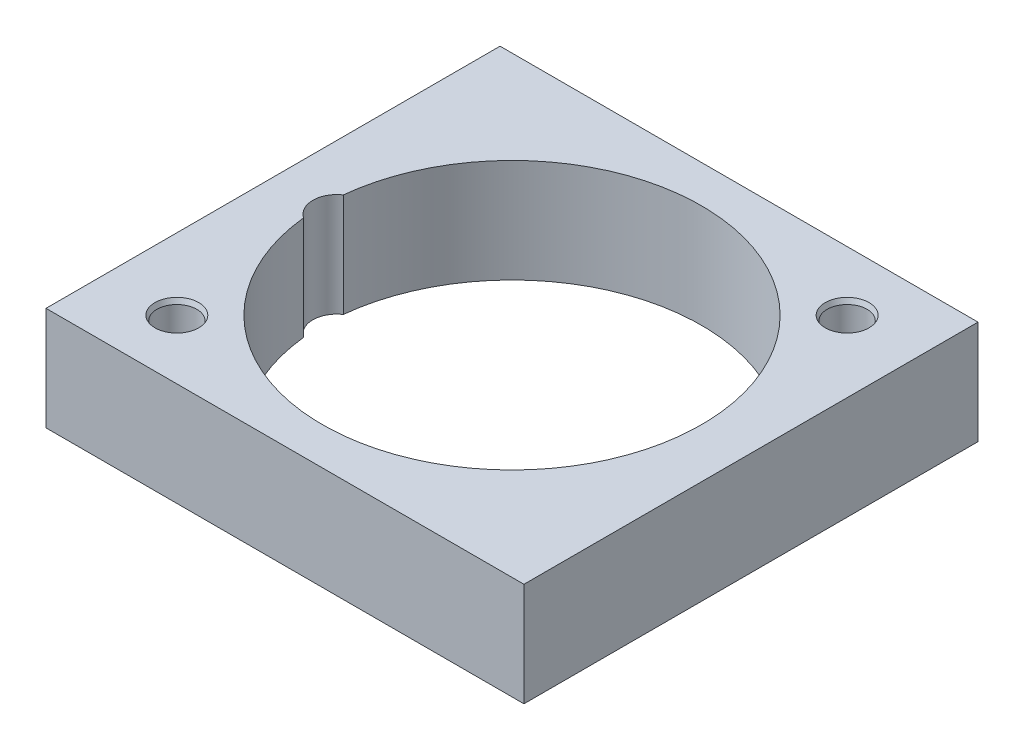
ISO-10303-21;
HEADER;
FILE_DESCRIPTION(('STEP AP214'),'2;1');
FILE_NAME('part.step','',(''),(''),'','','');
FILE_SCHEMA(('AUTOMOTIVE_DESIGN { 1 0 10303 214 1 1 1 1 }'));
ENDSEC;
DATA;
#1=APPLICATION_CONTEXT('core data for automotive mechanical design processes');
#2=APPLICATION_PROTOCOL_DEFINITION('international standard','automotive_design',2000,#1);
#3=PRODUCT_CONTEXT('',#1,'mechanical');
#4=PRODUCT('Part','Part','',(#3));
#5=PRODUCT_RELATED_PRODUCT_CATEGORY('part','',(#4));
#6=PRODUCT_DEFINITION_FORMATION('','',#4);
#7=PRODUCT_DEFINITION_CONTEXT('part definition',#1,'design');
#8=PRODUCT_DEFINITION('design','',#6,#7);
#9=PRODUCT_DEFINITION_SHAPE('','',#8);
#10=(LENGTH_UNIT() NAMED_UNIT(*) SI_UNIT(.MILLI.,.METRE.));
#11=(NAMED_UNIT(*) PLANE_ANGLE_UNIT() SI_UNIT($,.RADIAN.));
#12=(NAMED_UNIT(*) SI_UNIT($,.STERADIAN.) SOLID_ANGLE_UNIT());
#13=UNCERTAINTY_MEASURE_WITH_UNIT(LENGTH_MEASURE(1.E-05),#10,'distance_accuracy_value','');
#14=(GEOMETRIC_REPRESENTATION_CONTEXT(3) GLOBAL_UNCERTAINTY_ASSIGNED_CONTEXT((#13)) GLOBAL_UNIT_ASSIGNED_CONTEXT((#10,
#11,#12)) REPRESENTATION_CONTEXT('',''));
#15=CARTESIAN_POINT('',(0.,0.,0.));
#16=DIRECTION('',(0.,0.,1.));
#17=DIRECTION('',(1.,0.,0.));
#18=AXIS2_PLACEMENT_3D('',#15,#16,#17);
#19=CARTESIAN_POINT('',(30.,13.,-28.5));
#20=DIRECTION('',(0.,1.,0.));
#21=DIRECTION('',(0.,0.,1.));
#22=AXIS2_PLACEMENT_3D('',#19,#20,#21);
#23=PLANE('',#22);
#24=CARTESIAN_POINT('',(-21.0364267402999,13.,21.0364267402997));
#25=DIRECTION('',(0.,1.,0.));
#26=DIRECTION('',(0.,0.,1.));
#27=AXIS2_PLACEMENT_3D('',#24,#25,#26);
#28=CIRCLE('',#27,2.75);
#29=CARTESIAN_POINT('',(-21.0364267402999,13.,23.7864267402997));
#30=VERTEX_POINT('',#29);
#31=EDGE_CURVE('E104',#30,#30,#28,.T.);
#32=ORIENTED_EDGE('',*,*,#31,.F.);
#33=EDGE_LOOP('',(#32));
#34=FACE_BOUND('',#33,.T.);
#35=CARTESIAN_POINT('',(21.0364267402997,13.,-21.0364267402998));
#36=DIRECTION('',(0.,1.,0.));
#37=DIRECTION('',(0.,0.,1.));
#38=AXIS2_PLACEMENT_3D('',#35,#36,#37);
#39=CIRCLE('',#38,2.75);
#40=CARTESIAN_POINT('',(21.0364267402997,13.,-18.2864267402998));
#41=VERTEX_POINT('',#40);
#42=EDGE_CURVE('E115',#41,#41,#39,.T.);
#43=ORIENTED_EDGE('',*,*,#42,.F.);
#44=EDGE_LOOP('',(#43));
#45=FACE_BOUND('',#44,.T.);
#46=DIRECTION('',(0.,0.,-1.));
#47=VECTOR('',#46,1.);
#48=CARTESIAN_POINT('',(30.,13.,28.5));
#49=LINE('',#48,#47);
#50=CARTESIAN_POINT('',(30.,13.,28.5));
#51=VERTEX_POINT('',#50);
#52=CARTESIAN_POINT('',(30.,13.,-28.5));
#53=VERTEX_POINT('',#52);
#54=EDGE_CURVE('E131',#51,#53,#49,.T.);
#55=ORIENTED_EDGE('',*,*,#54,.T.);
#56=DIRECTION('',(-1.,0.,0.));
#57=VECTOR('',#56,1.);
#58=CARTESIAN_POINT('',(30.,13.,-28.5));
#59=LINE('',#58,#57);
#60=CARTESIAN_POINT('',(-30.,13.,-28.5));
#61=VERTEX_POINT('',#60);
#62=EDGE_CURVE('E134',#53,#61,#59,.T.);
#63=ORIENTED_EDGE('',*,*,#62,.T.);
#64=DIRECTION('',(0.,0.,1.));
#65=VECTOR('',#64,1.);
#66=CARTESIAN_POINT('',(-30.,13.,28.5));
#67=LINE('',#66,#65);
#68=CARTESIAN_POINT('',(-30.,13.,28.5));
#69=VERTEX_POINT('',#68);
#70=EDGE_CURVE('E137',#61,#69,#67,.T.);
#71=ORIENTED_EDGE('',*,*,#70,.T.);
#72=DIRECTION('',(1.,0.,0.));
#73=VECTOR('',#72,1.);
#74=CARTESIAN_POINT('',(30.,13.,28.5));
#75=LINE('',#74,#73);
#76=EDGE_CURVE('E140',#69,#51,#75,.T.);
#77=ORIENTED_EDGE('',*,*,#76,.T.);
#78=EDGE_LOOP('',(#55,#63,#71,#77));
#79=FACE_BOUND('',#78,.T.);
#80=CARTESIAN_POINT('',(0.,13.,0.));
#81=DIRECTION('',(0.,1.,0.));
#82=DIRECTION('',(0.,0.,-1.));
#83=AXIS2_PLACEMENT_3D('',#80,#81,#82);
#84=CIRCLE('',#83,23.8);
#85=CARTESIAN_POINT('',(-23.6690909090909,13.,2.49281678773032));
#86=VERTEX_POINT('',#85);
#87=CARTESIAN_POINT('',(-23.6690909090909,13.,-2.49281678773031));
#88=VERTEX_POINT('',#87);
#89=EDGE_CURVE('E120',#86,#88,#84,.T.);
#90=ORIENTED_EDGE('',*,*,#89,.F.);
#91=CARTESIAN_POINT('',(-22.,13.,0.));
#92=DIRECTION('',(0.,1.,0.));
#93=DIRECTION('',(0.,0.,-1.));
#94=AXIS2_PLACEMENT_3D('',#91,#92,#93);
#95=CIRCLE('',#94,3.00000000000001);
#96=EDGE_CURVE('E118',#88,#86,#95,.T.);
#97=ORIENTED_EDGE('',*,*,#96,.F.);
#98=EDGE_LOOP('',(#90,#97));
#99=FACE_BOUND('',#98,.T.);
#100=ADVANCED_FACE('F34',(#34,#45,#79,#99),#23,.T.);
#101=CARTESIAN_POINT('',(30.,0.,-28.5));
#102=DIRECTION('',(0.,1.,0.));
#103=DIRECTION('',(0.,0.,1.));
#104=AXIS2_PLACEMENT_3D('',#101,#102,#103);
#105=PLANE('',#104);
#106=DIRECTION('',(0.,0.,-1.));
#107=VECTOR('',#106,1.);
#108=CARTESIAN_POINT('',(30.,0.,28.5));
#109=LINE('',#108,#107);
#110=CARTESIAN_POINT('',(30.,0.,28.5));
#111=VERTEX_POINT('',#110);
#112=CARTESIAN_POINT('',(30.,0.,-28.5));
#113=VERTEX_POINT('',#112);
#114=EDGE_CURVE('E130',#111,#113,#109,.T.);
#115=ORIENTED_EDGE('',*,*,#114,.F.);
#116=DIRECTION('',(1.,0.,0.));
#117=VECTOR('',#116,1.);
#118=CARTESIAN_POINT('',(30.,0.,28.5));
#119=LINE('',#118,#117);
#120=CARTESIAN_POINT('',(-30.,0.,28.5));
#121=VERTEX_POINT('',#120);
#122=EDGE_CURVE('E135',#121,#111,#119,.T.);
#123=ORIENTED_EDGE('',*,*,#122,.F.);
#124=DIRECTION('',(0.,0.,1.));
#125=VECTOR('',#124,1.);
#126=CARTESIAN_POINT('',(-30.,0.,28.5));
#127=LINE('',#126,#125);
#128=CARTESIAN_POINT('',(-30.,0.,-28.5));
#129=VERTEX_POINT('',#128);
#130=EDGE_CURVE('E148',#129,#121,#127,.T.);
#131=ORIENTED_EDGE('',*,*,#130,.F.);
#132=DIRECTION('',(-1.,0.,0.));
#133=VECTOR('',#132,1.);
#134=CARTESIAN_POINT('',(30.,0.,-28.5));
#135=LINE('',#134,#133);
#136=EDGE_CURVE('E146',#113,#129,#135,.T.);
#137=ORIENTED_EDGE('',*,*,#136,.F.);
#138=EDGE_LOOP('',(#115,#123,#131,#137));
#139=FACE_BOUND('',#138,.T.);
#140=CARTESIAN_POINT('',(-22.,0.,0.));
#141=DIRECTION('',(0.,1.,0.));
#142=DIRECTION('',(0.,0.,-1.));
#143=AXIS2_PLACEMENT_3D('',#140,#141,#142);
#144=CIRCLE('',#143,3.00000000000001);
#145=CARTESIAN_POINT('',(-23.6690909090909,0.,-2.49281678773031));
#146=VERTEX_POINT('',#145);
#147=CARTESIAN_POINT('',(-23.6690909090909,0.,2.49281678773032));
#148=VERTEX_POINT('',#147);
#149=EDGE_CURVE('E56',#146,#148,#144,.T.);
#150=ORIENTED_EDGE('',*,*,#149,.T.);
#151=CARTESIAN_POINT('',(0.,0.,0.));
#152=DIRECTION('',(0.,1.,0.));
#153=DIRECTION('',(0.,0.,-1.));
#154=AXIS2_PLACEMENT_3D('',#151,#152,#153);
#155=CIRCLE('',#154,23.8);
#156=EDGE_CURVE('E121',#148,#146,#155,.T.);
#157=ORIENTED_EDGE('',*,*,#156,.T.);
#158=EDGE_LOOP('',(#150,#157));
#159=FACE_BOUND('',#158,.T.);
#160=ADVANCED_FACE('F167',(#139,#159),#105,.F.);
#161=CARTESIAN_POINT('',(30.,13.,28.5));
#162=DIRECTION('',(-1.,0.,0.));
#163=DIRECTION('',(0.,0.,1.));
#164=AXIS2_PLACEMENT_3D('',#161,#162,#163);
#165=PLANE('',#164);
#166=ORIENTED_EDGE('',*,*,#114,.T.);
#167=DIRECTION('',(0.,-1.,0.));
#168=VECTOR('',#167,1.);
#169=CARTESIAN_POINT('',(30.,13.,-28.5));
#170=LINE('',#169,#168);
#171=EDGE_CURVE('E11',#53,#113,#170,.T.);
#172=ORIENTED_EDGE('',*,*,#171,.F.);
#173=ORIENTED_EDGE('',*,*,#54,.F.);
#174=DIRECTION('',(0.,-1.,0.));
#175=VECTOR('',#174,1.);
#176=CARTESIAN_POINT('',(30.,13.,28.5));
#177=LINE('',#176,#175);
#178=EDGE_CURVE('E143',#51,#111,#177,.T.);
#179=ORIENTED_EDGE('',*,*,#178,.T.);
#180=EDGE_LOOP('',(#166,#172,#173,#179));
#181=FACE_BOUND('',#180,.T.);
#182=ADVANCED_FACE('F36',(#181),#165,.F.);
#183=CARTESIAN_POINT('',(30.,13.,-28.5));
#184=DIRECTION('',(0.,0.,1.));
#185=DIRECTION('',(1.,0.,0.));
#186=AXIS2_PLACEMENT_3D('',#183,#184,#185);
#187=PLANE('',#186);
#188=ORIENTED_EDGE('',*,*,#136,.T.);
#189=DIRECTION('',(0.,-1.,0.));
#190=VECTOR('',#189,1.);
#191=CARTESIAN_POINT('',(-30.,13.,-28.5));
#192=LINE('',#191,#190);
#193=EDGE_CURVE('E42',#61,#129,#192,.T.);
#194=ORIENTED_EDGE('',*,*,#193,.F.);
#195=ORIENTED_EDGE('',*,*,#62,.F.);
#196=ORIENTED_EDGE('',*,*,#171,.T.);
#197=EDGE_LOOP('',(#188,#194,#195,#196));
#198=FACE_BOUND('',#197,.T.);
#199=ADVANCED_FACE('F178',(#198),#187,.F.);
#200=CARTESIAN_POINT('',(-30.,13.,28.5));
#201=DIRECTION('',(1.,0.,0.));
#202=DIRECTION('',(0.,0.,-1.));
#203=AXIS2_PLACEMENT_3D('',#200,#201,#202);
#204=PLANE('',#203);
#205=ORIENTED_EDGE('',*,*,#130,.T.);
#206=DIRECTION('',(0.,-1.,0.));
#207=VECTOR('',#206,1.);
#208=CARTESIAN_POINT('',(-30.,13.,28.5));
#209=LINE('',#208,#207);
#210=EDGE_CURVE('E154',#69,#121,#209,.T.);
#211=ORIENTED_EDGE('',*,*,#210,.F.);
#212=ORIENTED_EDGE('',*,*,#70,.F.);
#213=ORIENTED_EDGE('',*,*,#193,.T.);
#214=EDGE_LOOP('',(#205,#211,#212,#213));
#215=FACE_BOUND('',#214,.T.);
#216=ADVANCED_FACE('F161',(#215),#204,.F.);
#217=CARTESIAN_POINT('',(30.,13.,28.5));
#218=DIRECTION('',(0.,0.,-1.));
#219=DIRECTION('',(-1.,0.,0.));
#220=AXIS2_PLACEMENT_3D('',#217,#218,#219);
#221=PLANE('',#220);
#222=ORIENTED_EDGE('',*,*,#122,.T.);
#223=ORIENTED_EDGE('',*,*,#178,.F.);
#224=ORIENTED_EDGE('',*,*,#76,.F.);
#225=ORIENTED_EDGE('',*,*,#210,.T.);
#226=EDGE_LOOP('',(#222,#223,#224,#225));
#227=FACE_BOUND('',#226,.T.);
#228=ADVANCED_FACE('F171',(#227),#221,.F.);
#229=CARTESIAN_POINT('',(-22.,13.,0.));
#230=DIRECTION('',(0.,-1.,0.));
#231=DIRECTION('',(0.,0.,-1.));
#232=AXIS2_PLACEMENT_3D('',#229,#230,#231);
#233=CYLINDRICAL_SURFACE('',#232,3.00000000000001);
#234=ORIENTED_EDGE('',*,*,#149,.F.);
#235=DIRECTION('',(0.,-1.,0.));
#236=VECTOR('',#235,1.);
#237=CARTESIAN_POINT('',(-23.6690909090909,13.,-2.49281678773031));
#238=LINE('',#237,#236);
#239=EDGE_CURVE('E124',#88,#146,#238,.T.);
#240=ORIENTED_EDGE('',*,*,#239,.F.);
#241=ORIENTED_EDGE('',*,*,#96,.T.);
#242=DIRECTION('',(0.,-1.,0.));
#243=VECTOR('',#242,1.);
#244=CARTESIAN_POINT('',(-23.6690909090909,13.,2.49281678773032));
#245=LINE('',#244,#243);
#246=EDGE_CURVE('E49',#86,#148,#245,.T.);
#247=ORIENTED_EDGE('',*,*,#246,.T.);
#248=EDGE_LOOP('',(#234,#240,#241,#247));
#249=FACE_BOUND('',#248,.T.);
#250=ADVANCED_FACE('F195',(#249),#233,.F.);
#251=CARTESIAN_POINT('',(0.,13.,0.));
#252=DIRECTION('',(0.,-1.,0.));
#253=DIRECTION('',(0.,0.,-1.));
#254=AXIS2_PLACEMENT_3D('',#251,#252,#253);
#255=CYLINDRICAL_SURFACE('',#254,23.8);
#256=ORIENTED_EDGE('',*,*,#156,.F.);
#257=ORIENTED_EDGE('',*,*,#246,.F.);
#258=ORIENTED_EDGE('',*,*,#89,.T.);
#259=ORIENTED_EDGE('',*,*,#239,.T.);
#260=EDGE_LOOP('',(#256,#257,#258,#259));
#261=FACE_BOUND('',#260,.T.);
#262=ADVANCED_FACE('F202',(#261),#255,.F.);
#263=CARTESIAN_POINT('',(21.0364267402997,13.,-21.0364267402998));
#264=DIRECTION('',(0.,1.,0.));
#265=DIRECTION('',(0.,0.,1.));
#266=AXIS2_PLACEMENT_3D('',#263,#264,#265);
#267=CONICAL_SURFACE('',#266,2.75,0.392699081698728);
#268=CARTESIAN_POINT('',(21.0364267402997,12.3964466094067,-21.0364267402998));
#269=DIRECTION('',(0.,1.,0.));
#270=DIRECTION('',(0.,0.,1.));
#271=AXIS2_PLACEMENT_3D('',#268,#269,#270);
#272=CIRCLE('',#271,2.5);
#273=CARTESIAN_POINT('',(21.0364267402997,12.3964466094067,-18.5364267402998));
#274=VERTEX_POINT('',#273);
#275=EDGE_CURVE('E112',#274,#274,#272,.T.);
#276=ORIENTED_EDGE('',*,*,#275,.F.);
#277=EDGE_LOOP('',(#276));
#278=FACE_BOUND('',#277,.T.);
#279=ORIENTED_EDGE('',*,*,#42,.T.);
#280=EDGE_LOOP('',(#279));
#281=FACE_BOUND('',#280,.T.);
#282=ADVANCED_FACE('F206',(#278,#281),#267,.F.);
#283=CARTESIAN_POINT('',(21.0364267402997,13.,-21.0364267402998));
#284=DIRECTION('',(0.,1.,0.));
#285=DIRECTION('',(0.,0.,1.));
#286=AXIS2_PLACEMENT_3D('',#283,#284,#285);
#287=CYLINDRICAL_SURFACE('',#286,2.5);
#288=CARTESIAN_POINT('',(21.0364267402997,5.,-21.0364267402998));
#289=DIRECTION('',(0.,1.,0.));
#290=DIRECTION('',(0.,0.,1.));
#291=AXIS2_PLACEMENT_3D('',#288,#289,#290);
#292=CIRCLE('',#291,2.5);
#293=CARTESIAN_POINT('',(21.0364267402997,5.,-18.5364267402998));
#294=VERTEX_POINT('',#293);
#295=EDGE_CURVE('E109',#294,#294,#292,.T.);
#296=ORIENTED_EDGE('',*,*,#295,.F.);
#297=EDGE_LOOP('',(#296));
#298=FACE_BOUND('',#297,.T.);
#299=ORIENTED_EDGE('',*,*,#275,.T.);
#300=EDGE_LOOP('',(#299));
#301=FACE_BOUND('',#300,.T.);
#302=ADVANCED_FACE('F210',(#298,#301),#287,.F.);
#303=CARTESIAN_POINT('',(21.0364267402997,5.,-21.0364267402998));
#304=DIRECTION('',(0.,1.,0.));
#305=DIRECTION('',(0.,0.,1.));
#306=AXIS2_PLACEMENT_3D('',#303,#304,#305);
#307=CONICAL_SURFACE('',#306,2.5,1.02974425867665);
#308=CARTESIAN_POINT('',(21.0364267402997,3.4978484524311,-21.0364267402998));
#309=VERTEX_POINT('',#308);
#310=VERTEX_LOOP('',#309);
#311=FACE_BOUND('',#310,.T.);
#312=ORIENTED_EDGE('',*,*,#295,.T.);
#313=EDGE_LOOP('',(#312));
#314=FACE_BOUND('',#313,.T.);
#315=ADVANCED_FACE('F216',(#311,#314),#307,.F.);
#316=CARTESIAN_POINT('',(-21.0364267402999,13.,21.0364267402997));
#317=DIRECTION('',(0.,1.,0.));
#318=DIRECTION('',(0.,0.,1.));
#319=AXIS2_PLACEMENT_3D('',#316,#317,#318);
#320=CONICAL_SURFACE('',#319,2.75,0.392699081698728);
#321=CARTESIAN_POINT('',(-21.0364267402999,12.3964466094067,21.0364267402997));
#322=DIRECTION('',(0.,1.,0.));
#323=DIRECTION('',(0.,0.,1.));
#324=AXIS2_PLACEMENT_3D('',#321,#322,#323);
#325=CIRCLE('',#324,2.5);
#326=CARTESIAN_POINT('',(-21.0364267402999,12.3964466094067,23.5364267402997));
#327=VERTEX_POINT('',#326);
#328=EDGE_CURVE('E101',#327,#327,#325,.T.);
#329=ORIENTED_EDGE('',*,*,#328,.F.);
#330=EDGE_LOOP('',(#329));
#331=FACE_BOUND('',#330,.T.);
#332=ORIENTED_EDGE('',*,*,#31,.T.);
#333=EDGE_LOOP('',(#332));
#334=FACE_BOUND('',#333,.T.);
#335=ADVANCED_FACE('F220',(#331,#334),#320,.F.);
#336=CARTESIAN_POINT('',(-21.0364267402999,13.,21.0364267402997));
#337=DIRECTION('',(0.,1.,0.));
#338=DIRECTION('',(0.,0.,1.));
#339=AXIS2_PLACEMENT_3D('',#336,#337,#338);
#340=CYLINDRICAL_SURFACE('',#339,2.5);
#341=CARTESIAN_POINT('',(-21.0364267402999,5.,21.0364267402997));
#342=DIRECTION('',(0.,1.,0.));
#343=DIRECTION('',(0.,0.,1.));
#344=AXIS2_PLACEMENT_3D('',#341,#342,#343);
#345=CIRCLE('',#344,2.5);
#346=CARTESIAN_POINT('',(-21.0364267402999,5.,23.5364267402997));
#347=VERTEX_POINT('',#346);
#348=EDGE_CURVE('E99',#347,#347,#345,.T.);
#349=ORIENTED_EDGE('',*,*,#348,.F.);
#350=EDGE_LOOP('',(#349));
#351=FACE_BOUND('',#350,.T.);
#352=ORIENTED_EDGE('',*,*,#328,.T.);
#353=EDGE_LOOP('',(#352));
#354=FACE_BOUND('',#353,.T.);
#355=ADVANCED_FACE('F95',(#351,#354),#340,.F.);
#356=CARTESIAN_POINT('',(-21.0364267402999,5.,21.0364267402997));
#357=DIRECTION('',(0.,1.,0.));
#358=DIRECTION('',(0.,0.,1.));
#359=AXIS2_PLACEMENT_3D('',#356,#357,#358);
#360=CONICAL_SURFACE('',#359,2.5,1.02974425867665);
#361=CARTESIAN_POINT('',(-21.0364267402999,3.4978484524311,21.0364267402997));
#362=VERTEX_POINT('',#361);
#363=VERTEX_LOOP('',#362);
#364=FACE_BOUND('',#363,.T.);
#365=ORIENTED_EDGE('',*,*,#348,.T.);
#366=EDGE_LOOP('',(#365));
#367=FACE_BOUND('',#366,.T.);
#368=ADVANCED_FACE('F92',(#364,#367),#360,.F.);
#369=CLOSED_SHELL('',(#100,#160,#182,#199,#216,#228,#250,#262,#282,#302,#315,#335,#355,#368));
#370=MANIFOLD_SOLID_BREP('B2',#369);
#371=ADVANCED_BREP_SHAPE_REPRESENTATION('',(#18,#370),#14);
#372=SHAPE_DEFINITION_REPRESENTATION(#9,#371);
ENDSEC;
END-ISO-10303-21;
